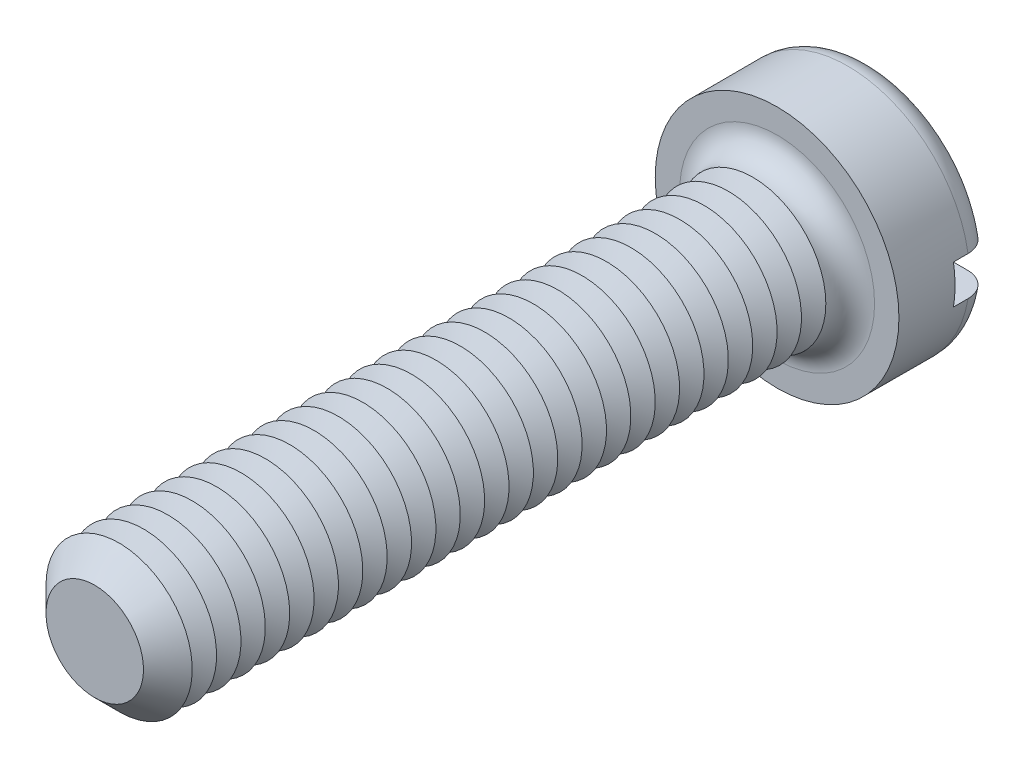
from build123d import *

# Parameters (mm, degrees)
SKETCH3_R           = 5
BOSS_EXTRUDE2_DEPTH = 3.9
SKETCH4_R           = 3
BOSS_EXTRUDE3_DEPTH = 28
FILLET1_R           = 1
CHAMFER1_SIZE       = 1
LPATTERN1_COUNT     = 26
LPATTERN1_PITCH     = 1
SKETCH8_W           = 10
SKETCH8_H           = 1.6
CUT_EXTRUDE1_DEPTH  = 1.6


with BuildPart() as part:
    # Sketch3 → Boss-Extrude2 (new body)
    with BuildSketch(Plane.XY):
        Circle(SKETCH3_R)
    extrude(amount=-BOSS_EXTRUDE2_DEPTH)

    # Sketch4 → Boss-Extrude3 (add)
    with BuildSketch(Plane.XY):
        Circle(SKETCH4_R)
    extrude(amount=BOSS_EXTRUDE3_DEPTH)

    # Fillet1
    fillet1_edges = [part.edges().sort_by_distance(p)[0] for p in [
        (-5, 0, -3.9),
        (-3, 0, 0),
    ]]
    fillet(fillet1_edges, radius=FILLET1_R)

    # Chamfer1
    chamfer1_edges = [part.edges().sort_by_distance(p)[0] for p in [
        (-3, 0, 28),
    ]]
    chamfer(chamfer1_edges, length=CHAMFER1_SIZE)

    # Sketch6 → Cut-Revolve1 (revolve, cut)
    with BuildSketch(Plane(origin=(0, 0, 0), x_dir=(0, 0, -1), z_dir=(1, 0, 0)), mode=Mode.PRIVATE) as cut_revolve1_sk:
        Polygon((-1, 3), (-1.5, 2.133974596), (-2, 3), align=None)
    cut_revolve1 = revolve(cut_revolve1_sk.sketch.rotate(Axis((0, 0, -1.694361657), (0, 0, 1)), 90), axis=Axis((0, 0, -1.694361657), (0, 0, 1)), mode=Mode.SUBTRACT)

    # LPattern1: Cut-Revolve1 ×26
    with Locations(*[(0, 0, i * LPATTERN1_PITCH) for i in range(1, LPATTERN1_COUNT)]):
        add(cut_revolve1, mode=Mode.SUBTRACT)

    # Sketch8 → Cut-Extrude1 (cut)
    with BuildSketch(Plane(origin=(0, 0, -3.9), x_dir=(-1, 0, 0), z_dir=(0, 0, -1))):
        Rectangle(SKETCH8_W, SKETCH8_H)
    extrude(amount=-CUT_EXTRUDE1_DEPTH, mode=Mode.SUBTRACT)


solid = part.part
